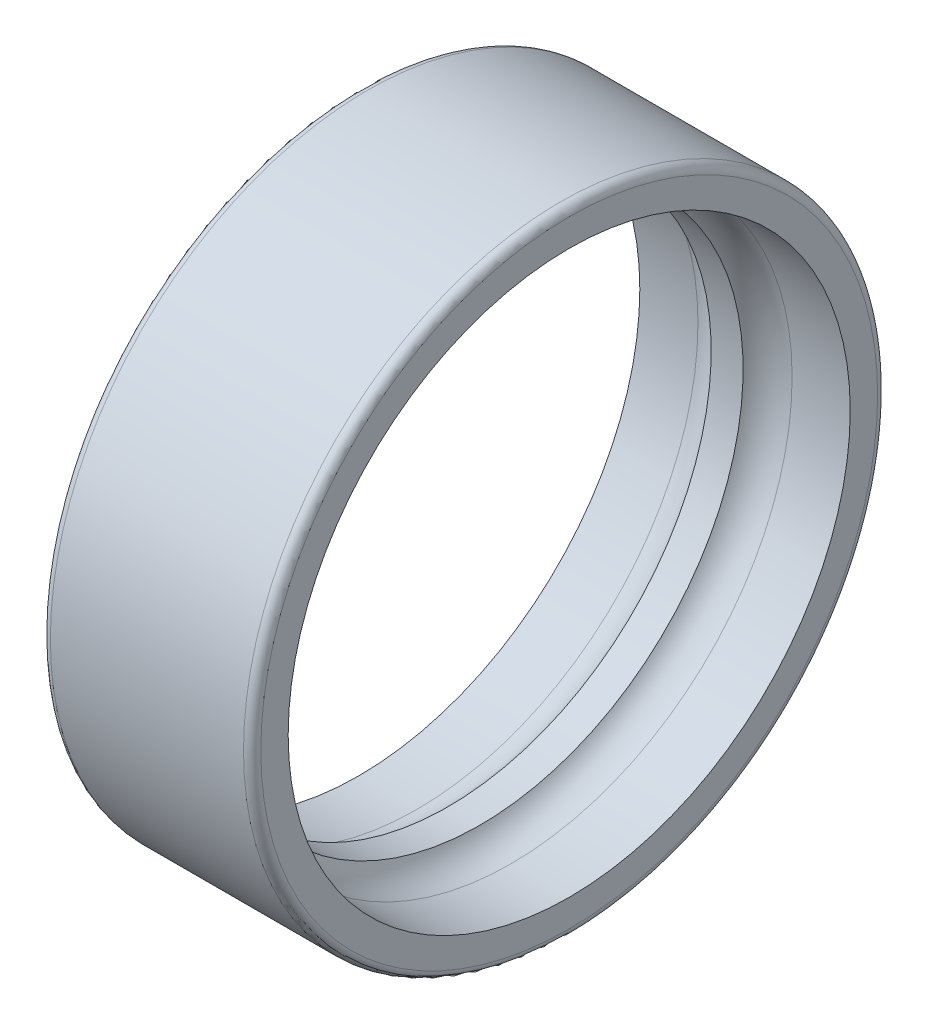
ISO-10303-21;
HEADER;
FILE_DESCRIPTION(('STEP AP214'),'2;1');
FILE_NAME('part.step','',(''),(''),'','','');
FILE_SCHEMA(('AUTOMOTIVE_DESIGN { 1 0 10303 214 1 1 1 1 }'));
ENDSEC;
DATA;
#1=APPLICATION_CONTEXT('core data for automotive mechanical design processes');
#2=APPLICATION_PROTOCOL_DEFINITION('international standard','automotive_design',2000,#1);
#3=PRODUCT_CONTEXT('',#1,'mechanical');
#4=PRODUCT('Part','Part','',(#3));
#5=PRODUCT_RELATED_PRODUCT_CATEGORY('part','',(#4));
#6=PRODUCT_DEFINITION_FORMATION('','',#4);
#7=PRODUCT_DEFINITION_CONTEXT('part definition',#1,'design');
#8=PRODUCT_DEFINITION('design','',#6,#7);
#9=PRODUCT_DEFINITION_SHAPE('','',#8);
#10=(LENGTH_UNIT() NAMED_UNIT(*) SI_UNIT(.MILLI.,.METRE.));
#11=(NAMED_UNIT(*) PLANE_ANGLE_UNIT() SI_UNIT($,.RADIAN.));
#12=(NAMED_UNIT(*) SI_UNIT($,.STERADIAN.) SOLID_ANGLE_UNIT());
#13=UNCERTAINTY_MEASURE_WITH_UNIT(LENGTH_MEASURE(1.E-05),#10,'distance_accuracy_value','');
#14=(GEOMETRIC_REPRESENTATION_CONTEXT(3) GLOBAL_UNCERTAINTY_ASSIGNED_CONTEXT((#13)) GLOBAL_UNIT_ASSIGNED_CONTEXT((#10,
#11,#12)) REPRESENTATION_CONTEXT('',''));
#15=CARTESIAN_POINT('',(0.,0.,0.));
#16=DIRECTION('',(0.,0.,1.));
#17=DIRECTION('',(1.,0.,0.));
#18=AXIS2_PLACEMENT_3D('',#15,#16,#17);
#19=CARTESIAN_POINT('',(-16.75,0.,0.));
#20=DIRECTION('',(-1.,0.,0.));
#21=DIRECTION('',(0.,0.,1.));
#22=AXIS2_PLACEMENT_3D('',#19,#20,#21);
#23=TOROIDAL_SURFACE('',#22,53.5,1.50000000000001);
#24=CARTESIAN_POINT('',(-18.25,0.,0.));
#25=DIRECTION('',(-1.,0.,0.));
#26=DIRECTION('',(0.,0.,1.));
#27=AXIS2_PLACEMENT_3D('',#24,#25,#26);
#28=CIRCLE('',#27,53.5);
#29=CARTESIAN_POINT('',(-18.25,0.,53.5));
#30=VERTEX_POINT('',#29);
#31=EDGE_CURVE('E10',#30,#30,#28,.T.);
#32=ORIENTED_EDGE('',*,*,#31,.F.);
#33=EDGE_LOOP('',(#32));
#34=FACE_BOUND('',#33,.T.);
#35=CARTESIAN_POINT('',(-16.75,0.,0.));
#36=DIRECTION('',(-1.,0.,0.));
#37=DIRECTION('',(0.,0.,1.));
#38=AXIS2_PLACEMENT_3D('',#35,#36,#37);
#39=CIRCLE('',#38,55.);
#40=CARTESIAN_POINT('',(-16.75,0.,55.));
#41=VERTEX_POINT('',#40);
#42=EDGE_CURVE('E63',#41,#41,#39,.T.);
#43=ORIENTED_EDGE('',*,*,#42,.T.);
#44=EDGE_LOOP('',(#43));
#45=FACE_BOUND('',#44,.T.);
#46=ADVANCED_FACE('F29',(#34,#45),#23,.T.);
#47=CARTESIAN_POINT('',(-18.25,53.5,0.));
#48=DIRECTION('',(1.,0.,0.));
#49=DIRECTION('',(0.,0.,-1.));
#50=AXIS2_PLACEMENT_3D('',#47,#48,#49);
#51=PLANE('',#50);
#52=CARTESIAN_POINT('',(-18.25,0.,0.));
#53=DIRECTION('',(-1.,0.,0.));
#54=DIRECTION('',(0.,0.,1.));
#55=AXIS2_PLACEMENT_3D('',#52,#53,#54);
#56=CIRCLE('',#55,48.75);
#57=CARTESIAN_POINT('',(-18.25,0.,48.75));
#58=VERTEX_POINT('',#57);
#59=EDGE_CURVE('E35',#58,#58,#56,.T.);
#60=ORIENTED_EDGE('',*,*,#59,.F.);
#61=EDGE_LOOP('',(#60));
#62=FACE_BOUND('',#61,.T.);
#63=ORIENTED_EDGE('',*,*,#31,.T.);
#64=EDGE_LOOP('',(#63));
#65=FACE_BOUND('',#64,.T.);
#66=ADVANCED_FACE('F112',(#62,#65),#51,.F.);
#67=CARTESIAN_POINT('',(0.,0.,0.));
#68=DIRECTION('',(-1.,0.,0.));
#69=DIRECTION('',(0.,0.,1.));
#70=AXIS2_PLACEMENT_3D('',#67,#68,#69);
#71=CYLINDRICAL_SURFACE('',#70,48.75);
#72=CARTESIAN_POINT('',(-8.16666666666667,0.,0.));
#73=DIRECTION('',(-1.,0.,0.));
#74=DIRECTION('',(0.,0.,1.));
#75=AXIS2_PLACEMENT_3D('',#72,#73,#74);
#76=CIRCLE('',#75,48.75);
#77=CARTESIAN_POINT('',(-8.16666666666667,0.,48.75));
#78=VERTEX_POINT('',#77);
#79=EDGE_CURVE('E39',#78,#78,#76,.T.);
#80=ORIENTED_EDGE('',*,*,#79,.F.);
#81=EDGE_LOOP('',(#80));
#82=FACE_BOUND('',#81,.T.);
#83=ORIENTED_EDGE('',*,*,#59,.T.);
#84=EDGE_LOOP('',(#83));
#85=FACE_BOUND('',#84,.T.);
#86=ADVANCED_FACE('F107',(#82,#85),#71,.F.);
#87=CARTESIAN_POINT('',(-8.16666666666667,0.,0.));
#88=DIRECTION('',(-1.,0.,0.));
#89=DIRECTION('',(0.,0.,1.));
#90=AXIS2_PLACEMENT_3D('',#87,#88,#89);
#91=TOROIDAL_SURFACE('',#90,42.5,6.25);
#92=CARTESIAN_POINT('',(-2.76851883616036,0.,0.));
#93=DIRECTION('',(-1.,0.,0.));
#94=DIRECTION('',(0.,0.,1.));
#95=AXIS2_PLACEMENT_3D('',#92,#93,#94);
#96=CIRCLE('',#95,45.65);
#97=CARTESIAN_POINT('',(-2.76851883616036,0.,45.65));
#98=VERTEX_POINT('',#97);
#99=EDGE_CURVE('E43',#98,#98,#96,.T.);
#100=ORIENTED_EDGE('',*,*,#99,.F.);
#101=EDGE_LOOP('',(#100));
#102=FACE_BOUND('',#101,.T.);
#103=ORIENTED_EDGE('',*,*,#79,.T.);
#104=EDGE_LOOP('',(#103));
#105=FACE_BOUND('',#104,.T.);
#106=ADVANCED_FACE('F101',(#102,#105),#91,.F.);
#107=CARTESIAN_POINT('',(0.,0.,0.));
#108=DIRECTION('',(-1.,0.,0.));
#109=DIRECTION('',(0.,0.,1.));
#110=AXIS2_PLACEMENT_3D('',#107,#108,#109);
#111=CYLINDRICAL_SURFACE('',#110,45.65);
#112=CARTESIAN_POINT('',(2.76851883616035,0.,0.));
#113=DIRECTION('',(-1.,0.,0.));
#114=DIRECTION('',(0.,0.,1.));
#115=AXIS2_PLACEMENT_3D('',#112,#113,#114);
#116=CIRCLE('',#115,45.65);
#117=CARTESIAN_POINT('',(2.76851883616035,0.,45.65));
#118=VERTEX_POINT('',#117);
#119=EDGE_CURVE('E48',#118,#118,#116,.T.);
#120=ORIENTED_EDGE('',*,*,#119,.F.);
#121=EDGE_LOOP('',(#120));
#122=FACE_BOUND('',#121,.T.);
#123=ORIENTED_EDGE('',*,*,#99,.T.);
#124=EDGE_LOOP('',(#123));
#125=FACE_BOUND('',#124,.T.);
#126=ADVANCED_FACE('F95',(#122,#125),#111,.F.);
#127=CARTESIAN_POINT('',(8.16666666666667,0.,0.));
#128=DIRECTION('',(-1.,0.,0.));
#129=DIRECTION('',(0.,0.,1.));
#130=AXIS2_PLACEMENT_3D('',#127,#128,#129);
#131=TOROIDAL_SURFACE('',#130,42.5,6.25);
#132=CARTESIAN_POINT('',(8.16666666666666,0.,0.));
#133=DIRECTION('',(-1.,0.,0.));
#134=DIRECTION('',(0.,0.,1.));
#135=AXIS2_PLACEMENT_3D('',#132,#133,#134);
#136=CIRCLE('',#135,48.75);
#137=CARTESIAN_POINT('',(8.16666666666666,0.,48.75));
#138=VERTEX_POINT('',#137);
#139=EDGE_CURVE('E51',#138,#138,#136,.T.);
#140=ORIENTED_EDGE('',*,*,#139,.F.);
#141=EDGE_LOOP('',(#140));
#142=FACE_BOUND('',#141,.T.);
#143=ORIENTED_EDGE('',*,*,#119,.T.);
#144=EDGE_LOOP('',(#143));
#145=FACE_BOUND('',#144,.T.);
#146=ADVANCED_FACE('F89',(#142,#145),#131,.F.);
#147=CARTESIAN_POINT('',(0.,0.,0.));
#148=DIRECTION('',(-1.,0.,0.));
#149=DIRECTION('',(0.,0.,1.));
#150=AXIS2_PLACEMENT_3D('',#147,#148,#149);
#151=CYLINDRICAL_SURFACE('',#150,48.75);
#152=CARTESIAN_POINT('',(18.25,0.,0.));
#153=DIRECTION('',(-1.,0.,0.));
#154=DIRECTION('',(0.,0.,1.));
#155=AXIS2_PLACEMENT_3D('',#152,#153,#154);
#156=CIRCLE('',#155,48.75);
#157=CARTESIAN_POINT('',(18.25,0.,48.75));
#158=VERTEX_POINT('',#157);
#159=EDGE_CURVE('E54',#158,#158,#156,.T.);
#160=ORIENTED_EDGE('',*,*,#159,.F.);
#161=EDGE_LOOP('',(#160));
#162=FACE_BOUND('',#161,.T.);
#163=ORIENTED_EDGE('',*,*,#139,.T.);
#164=EDGE_LOOP('',(#163));
#165=FACE_BOUND('',#164,.T.);
#166=ADVANCED_FACE('F83',(#162,#165),#151,.F.);
#167=CARTESIAN_POINT('',(18.25,53.5,0.));
#168=DIRECTION('',(-1.,0.,0.));
#169=DIRECTION('',(0.,0.,1.));
#170=AXIS2_PLACEMENT_3D('',#167,#168,#169);
#171=PLANE('',#170);
#172=CARTESIAN_POINT('',(18.25,0.,0.));
#173=DIRECTION('',(-1.,0.,0.));
#174=DIRECTION('',(0.,0.,1.));
#175=AXIS2_PLACEMENT_3D('',#172,#173,#174);
#176=CIRCLE('',#175,53.5);
#177=CARTESIAN_POINT('',(18.25,0.,53.5));
#178=VERTEX_POINT('',#177);
#179=EDGE_CURVE('E57',#178,#178,#176,.T.);
#180=ORIENTED_EDGE('',*,*,#179,.F.);
#181=EDGE_LOOP('',(#180));
#182=FACE_BOUND('',#181,.T.);
#183=ORIENTED_EDGE('',*,*,#159,.T.);
#184=EDGE_LOOP('',(#183));
#185=FACE_BOUND('',#184,.T.);
#186=ADVANCED_FACE('F77',(#182,#185),#171,.F.);
#187=CARTESIAN_POINT('',(16.75,0.,0.));
#188=DIRECTION('',(-1.,0.,0.));
#189=DIRECTION('',(0.,0.,1.));
#190=AXIS2_PLACEMENT_3D('',#187,#188,#189);
#191=TOROIDAL_SURFACE('',#190,53.5,1.50000000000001);
#192=CARTESIAN_POINT('',(16.75,0.,0.));
#193=DIRECTION('',(-1.,0.,0.));
#194=DIRECTION('',(0.,0.,1.));
#195=AXIS2_PLACEMENT_3D('',#192,#193,#194);
#196=CIRCLE('',#195,55.);
#197=CARTESIAN_POINT('',(16.75,0.,55.));
#198=VERTEX_POINT('',#197);
#199=EDGE_CURVE('E60',#198,#198,#196,.T.);
#200=ORIENTED_EDGE('',*,*,#199,.F.);
#201=EDGE_LOOP('',(#200));
#202=FACE_BOUND('',#201,.T.);
#203=ORIENTED_EDGE('',*,*,#179,.T.);
#204=EDGE_LOOP('',(#203));
#205=FACE_BOUND('',#204,.T.);
#206=ADVANCED_FACE('F71',(#202,#205),#191,.T.);
#207=CARTESIAN_POINT('',(0.,0.,0.));
#208=DIRECTION('',(-1.,0.,0.));
#209=DIRECTION('',(0.,0.,1.));
#210=AXIS2_PLACEMENT_3D('',#207,#208,#209);
#211=CYLINDRICAL_SURFACE('',#210,55.);
#212=ORIENTED_EDGE('',*,*,#42,.F.);
#213=EDGE_LOOP('',(#212));
#214=FACE_BOUND('',#213,.T.);
#215=ORIENTED_EDGE('',*,*,#199,.T.);
#216=EDGE_LOOP('',(#215));
#217=FACE_BOUND('',#216,.T.);
#218=ADVANCED_FACE('F68',(#214,#217),#211,.T.);
#219=CLOSED_SHELL('',(#46,#66,#86,#106,#126,#146,#166,#186,#206,#218));
#220=MANIFOLD_SOLID_BREP('B2',#219);
#221=ADVANCED_BREP_SHAPE_REPRESENTATION('',(#18,#220),#14);
#222=SHAPE_DEFINITION_REPRESENTATION(#9,#221);
ENDSEC;
END-ISO-10303-21;
